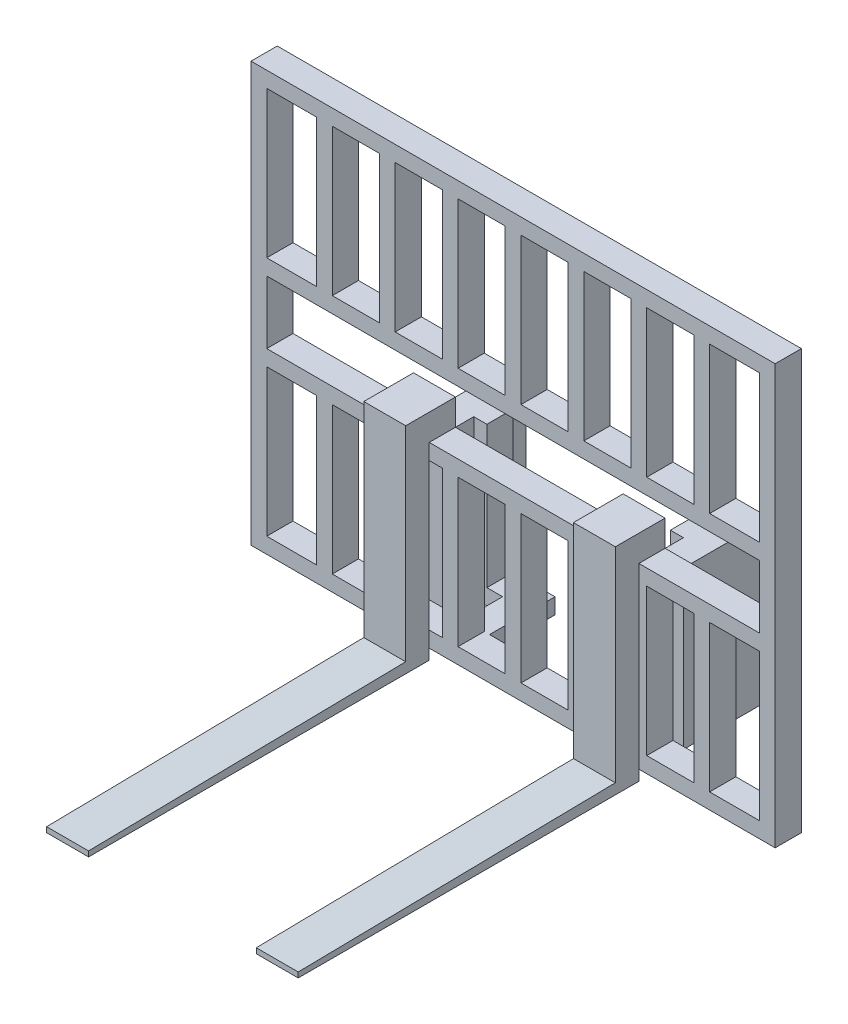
from build123d import *

# Parameters (mm, degrees)
SKETCH_1_W      = 1000
SKETCH_1_H      = 800
SKETCH_1_W_2    = 95
SKETCH_1_H_2    = 280
SKETCH_1_W_3    = 90
SKETCH_1_W_4    = 940
SKETCH_1_H_3    = 120
EXTRUDE_1_DEPTH = 50
EXTRUDE_START   = -200
EXTRUDE_2_DEPTH = 40
SKETCH_3_W      = 50
SKETCH_3_H      = 75
SKETCH_3_W_2    = 80
SKETCH_3_H_2    = 50
EXTRUDE_3_DEPTH = 30
SKETCH_3_3_W    = 25
SKETCH_3_3_H    = 50
EXTRUDE_4_DEPTH = 300


with BuildPart() as part:
    # Sketch 1 → Extrude 1 (new body)
    with BuildSketch(Plane.XY):
        with Locations((0, 350)):
            Rectangle(SKETCH_1_W, SKETCH_1_H)
        with Locations((-422.5, 120)):
            Rectangle(SKETCH_1_W_2, SKETCH_1_H_2, mode=Mode.SUBTRACT)
        with Locations((-300, 120)):
            Rectangle(SKETCH_1_W_3, SKETCH_1_H_2, mode=Mode.SUBTRACT)
        with Locations((-180, 120)):
            Rectangle(SKETCH_1_W_3, SKETCH_1_H_2, mode=Mode.SUBTRACT)
        with Locations((-60, 120)):
            Rectangle(SKETCH_1_W_3, SKETCH_1_H_2, mode=Mode.SUBTRACT)
        with Locations((60, 120)):
            Rectangle(SKETCH_1_W_3, SKETCH_1_H_2, mode=Mode.SUBTRACT)
        with Locations((180, 120)):
            Rectangle(SKETCH_1_W_3, SKETCH_1_H_2, mode=Mode.SUBTRACT)
        with Locations((422.5, 120)):
            Rectangle(SKETCH_1_W_2, SKETCH_1_H_2, mode=Mode.SUBTRACT)
        with Locations((300, 120)):
            Rectangle(SKETCH_1_W_3, SKETCH_1_H_2, mode=Mode.SUBTRACT)
        with Locations((-422.5, 580)):
            Rectangle(SKETCH_1_W_2, SKETCH_1_H_2, mode=Mode.SUBTRACT)
        with Locations((-300, 580)):
            Rectangle(SKETCH_1_W_3, SKETCH_1_H_2, mode=Mode.SUBTRACT)
        with Locations((-180, 580)):
            Rectangle(SKETCH_1_W_3, SKETCH_1_H_2, mode=Mode.SUBTRACT)
        with Locations((-60, 580)):
            Rectangle(SKETCH_1_W_3, SKETCH_1_H_2, mode=Mode.SUBTRACT)
        with Locations((0, 350)):
            Rectangle(SKETCH_1_W_4, SKETCH_1_H_3, mode=Mode.SUBTRACT)
        with Locations((60, 580)):
            Rectangle(SKETCH_1_W_3, SKETCH_1_H_2, mode=Mode.SUBTRACT)
        with Locations((180, 580)):
            Rectangle(SKETCH_1_W_3, SKETCH_1_H_2, mode=Mode.SUBTRACT)
        with Locations((300, 580)):
            Rectangle(SKETCH_1_W_3, SKETCH_1_H_2, mode=Mode.SUBTRACT)
        with Locations((422.5, 580)):
            Rectangle(SKETCH_1_W_2, SKETCH_1_H_2, mode=Mode.SUBTRACT)
    extrude(amount=EXTRUDE_1_DEPTH)

    # Sketch 2 → Extrude 2 (add, symmetric)
    with BuildSketch(Plane(origin=(0, 0, 0), x_dir=(0, 0, -1), z_dir=(1, 0, 0)).offset(EXTRUDE_START)):
        Polygon((-50, 290), (0, 290), (0, 340), (-94.889266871, 340), (-94.889266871, -50), (-700, -60), (-700, -70), (-50, -70), align=None)
    extrude_2 = extrude(amount=EXTRUDE_2_DEPTH, both=True)

    # Mirror 1: Extrude 2 across plane
    add(extrude_2.mirror(Plane(origin=(0, 0, 0), x_dir=(0, 0, 1), z_dir=(1, 0, 0))))

    # Sketch 3 → Extrude 3 (add)
    with BuildSketch(Plane.XZ.offset(50)):
        with Locations((-120, -37.5)):
            Rectangle(SKETCH_3_W, SKETCH_3_H)
        with Locations((-135, -100)):
            Rectangle(SKETCH_3_W_2, SKETCH_3_H_2)
    extrude_3 = extrude(amount=-EXTRUDE_3_DEPTH)

    # Sketch 3_3 → Extrude 4 (add)
    with BuildSketch(Plane.XZ.offset(50)):
        Polygon((-225, -75), (-200, -75), (-200, -25), (-250, -25), (-250, -175), (-200, -175), (-200, -125), (-225, -125), align=None)
        with Locations((-187.5, -100)):
            Rectangle(SKETCH_3_3_W, SKETCH_3_3_H)
        with Locations((-212.5, -100)):
            Rectangle(SKETCH_3_3_W, SKETCH_3_3_H)
    extrude_4 = extrude(amount=-EXTRUDE_4_DEPTH)

    # Mirror 2: Extrude 3, Extrude 4 across plane
    add(extrude_3.mirror(Plane(origin=(0, 0, 0), x_dir=(0, 0, 1), z_dir=(1, 0, 0))))
    add(extrude_4.mirror(Plane(origin=(0, 0, 0), x_dir=(0, 0, 1), z_dir=(1, 0, 0))))


solid = part.part
